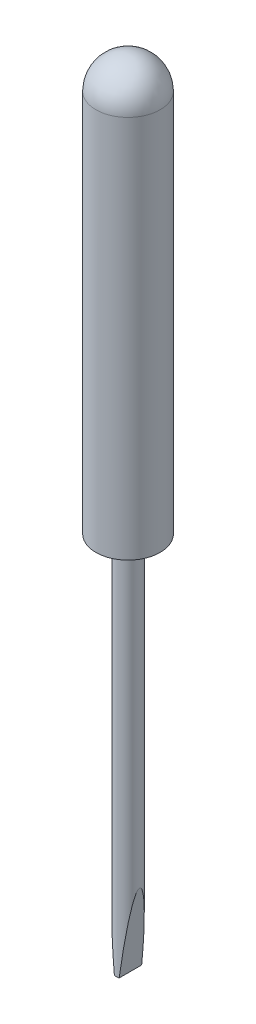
ISO-10303-21;
HEADER;
FILE_DESCRIPTION(('STEP AP214'),'2;1');
FILE_NAME('part.step','',(''),(''),'','','');
FILE_SCHEMA(('AUTOMOTIVE_DESIGN { 1 0 10303 214 1 1 1 1 }'));
ENDSEC;
DATA;
#1=APPLICATION_CONTEXT('core data for automotive mechanical design processes');
#2=APPLICATION_PROTOCOL_DEFINITION('international standard','automotive_design',2000,#1);
#3=PRODUCT_CONTEXT('',#1,'mechanical');
#4=PRODUCT('Part','Part','',(#3));
#5=PRODUCT_RELATED_PRODUCT_CATEGORY('part','',(#4));
#6=PRODUCT_DEFINITION_FORMATION('','',#4);
#7=PRODUCT_DEFINITION_CONTEXT('part definition',#1,'design');
#8=PRODUCT_DEFINITION('design','',#6,#7);
#9=PRODUCT_DEFINITION_SHAPE('','',#8);
#10=(LENGTH_UNIT() NAMED_UNIT(*) SI_UNIT(.MILLI.,.METRE.));
#11=(NAMED_UNIT(*) PLANE_ANGLE_UNIT() SI_UNIT($,.RADIAN.));
#12=(NAMED_UNIT(*) SI_UNIT($,.STERADIAN.) SOLID_ANGLE_UNIT());
#13=UNCERTAINTY_MEASURE_WITH_UNIT(LENGTH_MEASURE(1.E-05),#10,'distance_accuracy_value','');
#14=(GEOMETRIC_REPRESENTATION_CONTEXT(3) GLOBAL_UNCERTAINTY_ASSIGNED_CONTEXT((#13)) GLOBAL_UNIT_ASSIGNED_CONTEXT((#10,
#11,#12)) REPRESENTATION_CONTEXT('',''));
#15=CARTESIAN_POINT('',(0.,0.,0.));
#16=DIRECTION('',(0.,0.,1.));
#17=DIRECTION('',(1.,0.,0.));
#18=AXIS2_PLACEMENT_3D('',#15,#16,#17);
#19=CARTESIAN_POINT('',(0.,50.,0.));
#20=DIRECTION('',(0.,-1.,0.));
#21=DIRECTION('',(0.,0.,-1.));
#22=AXIS2_PLACEMENT_3D('',#19,#20,#21);
#23=CYLINDRICAL_SURFACE('',#22,1.524);
#24=CARTESIAN_POINT('',(0.,50.,0.));
#25=DIRECTION('',(0.,1.,0.));
#26=DIRECTION('',(0.,0.,1.));
#27=AXIS2_PLACEMENT_3D('',#24,#25,#26);
#28=CIRCLE('',#27,1.524);
#29=CARTESIAN_POINT('',(0.,50.,1.524));
#30=VERTEX_POINT('',#29);
#31=EDGE_CURVE('E83',#30,#30,#28,.T.);
#32=ORIENTED_EDGE('',*,*,#31,.F.);
#33=EDGE_LOOP('',(#32));
#34=FACE_BOUND('',#33,.T.);
#35=CARTESIAN_POINT('',(0.,0.,0.));
#36=DIRECTION('',(0.,1.,0.));
#37=DIRECTION('',(0.,0.,1.));
#38=AXIS2_PLACEMENT_3D('',#35,#36,#37);
#39=CIRCLE('',#38,1.524);
#40=CARTESIAN_POINT('',(-0.3175,0.,1.4905602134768));
#41=VERTEX_POINT('',#40);
#42=CARTESIAN_POINT('',(0.3175,0.,1.4905602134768));
#43=VERTEX_POINT('',#42);
#44=EDGE_CURVE('E73',#41,#43,#39,.T.);
#45=ORIENTED_EDGE('',*,*,#44,.T.);
#46=CARTESIAN_POINT('',(0.,-2.67368421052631,0.));
#47=DIRECTION('',(-0.99302292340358,0.117921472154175,0.));
#48=DIRECTION('',(-0.117921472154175,-0.99302292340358,0.));
#49=AXIS2_PLACEMENT_3D('',#46,#47,#48);
#50=ELLIPSE('',#49,12.9238549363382,1.524);
#51=CARTESIAN_POINT('',(0.3175,0.,-1.4905602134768));
#52=VERTEX_POINT('',#51);
#53=EDGE_CURVE('E60',#43,#52,#50,.T.);
#54=ORIENTED_EDGE('',*,*,#53,.T.);
#55=CARTESIAN_POINT('',(-0.3175,0.,-1.4905602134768));
#56=VERTEX_POINT('',#55);
#57=EDGE_CURVE('E66',#52,#56,#39,.T.);
#58=ORIENTED_EDGE('',*,*,#57,.T.);
#59=CARTESIAN_POINT('',(0.,-2.67368421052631,0.));
#60=DIRECTION('',(0.99302292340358,0.117921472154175,0.));
#61=DIRECTION('',(0.117921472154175,-0.99302292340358,0.));
#62=AXIS2_PLACEMENT_3D('',#59,#60,#61);
#63=ELLIPSE('',#62,12.9238549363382,1.524);
#64=EDGE_CURVE('E74',#56,#41,#63,.T.);
#65=ORIENTED_EDGE('',*,*,#64,.T.);
#66=EDGE_LOOP('',(#45,#54,#58,#65));
#67=FACE_BOUND('',#66,.T.);
#68=ADVANCED_FACE('F46',(#34,#67),#23,.T.);
#69=CARTESIAN_POINT('',(0.,0.,0.));
#70=DIRECTION('',(0.,1.,0.));
#71=DIRECTION('',(0.,0.,1.));
#72=AXIS2_PLACEMENT_3D('',#69,#70,#71);
#73=PLANE('',#72);
#74=ORIENTED_EDGE('',*,*,#57,.F.);
#75=DIRECTION('',(0.,0.,1.));
#76=VECTOR('',#75,1.);
#77=CARTESIAN_POINT('',(0.3175,0.,0.));
#78=LINE('',#77,#76);
#79=EDGE_CURVE('E13',#52,#43,#78,.T.);
#80=ORIENTED_EDGE('',*,*,#79,.T.);
#81=ORIENTED_EDGE('',*,*,#44,.F.);
#82=DIRECTION('',(0.,0.,-1.));
#83=VECTOR('',#82,1.);
#84=CARTESIAN_POINT('',(-0.3175,0.,0.));
#85=LINE('',#84,#83);
#86=EDGE_CURVE('E54',#41,#56,#85,.T.);
#87=ORIENTED_EDGE('',*,*,#86,.T.);
#88=EDGE_LOOP('',(#74,#80,#81,#87));
#89=FACE_BOUND('',#88,.T.);
#90=ADVANCED_FACE('F79',(#89),#73,.F.);
#91=CARTESIAN_POINT('',(0.,50.,0.));
#92=DIRECTION('',(0.,1.,0.));
#93=DIRECTION('',(0.,0.,1.));
#94=AXIS2_PLACEMENT_3D('',#91,#92,#93);
#95=PLANE('',#94);
#96=CARTESIAN_POINT('',(0.,50.,0.));
#97=DIRECTION('',(0.,1.,0.));
#98=DIRECTION('',(0.,0.,1.));
#99=AXIS2_PLACEMENT_3D('',#96,#97,#98);
#100=CIRCLE('',#99,4.25);
#101=CARTESIAN_POINT('',(0.,50.,-4.25));
#102=VERTEX_POINT('',#101);
#103=EDGE_CURVE('E85',#102,#102,#100,.T.);
#104=ORIENTED_EDGE('',*,*,#103,.F.);
#105=EDGE_LOOP('',(#104));
#106=FACE_BOUND('',#105,.T.);
#107=ORIENTED_EDGE('',*,*,#31,.T.);
#108=EDGE_LOOP('',(#107));
#109=FACE_BOUND('',#108,.T.);
#110=ADVANCED_FACE('F92',(#106,#109),#95,.F.);
#111=CARTESIAN_POINT('',(0.,100.75,0.));
#112=DIRECTION('',(0.,-1.,0.));
#113=DIRECTION('',(0.,0.,-1.));
#114=AXIS2_PLACEMENT_3D('',#111,#112,#113);
#115=CYLINDRICAL_SURFACE('',#114,4.25);
#116=CARTESIAN_POINT('',(0.,100.75,0.));
#117=DIRECTION('',(0.,1.,0.));
#118=DIRECTION('',(0.,0.,1.));
#119=AXIS2_PLACEMENT_3D('',#116,#117,#118);
#120=CIRCLE('',#119,4.25);
#121=CARTESIAN_POINT('',(0.,100.75,-4.25));
#122=VERTEX_POINT('',#121);
#123=EDGE_CURVE('E81',#122,#122,#120,.T.);
#124=CARTESIAN_POINT('',(0.,100.75,-4.25));
#125=CARTESIAN_POINT('',(0.,100.221354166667,-4.25));
#126=CARTESIAN_POINT('',(0.,99.6927083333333,-4.25));
#127=CARTESIAN_POINT('',(0.,98.6354166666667,-4.25));
#128=CARTESIAN_POINT('',(0.,98.1067708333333,-4.25));
#129=CARTESIAN_POINT('',(0.,97.0494791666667,-4.25));
#130=CARTESIAN_POINT('',(0.,96.5208333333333,-4.25));
#131=CARTESIAN_POINT('',(0.,95.4635416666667,-4.25));
#132=CARTESIAN_POINT('',(0.,94.9348958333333,-4.25));
#133=CARTESIAN_POINT('',(0.,93.8776041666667,-4.25));
#134=CARTESIAN_POINT('',(0.,93.3489583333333,-4.25));
#135=CARTESIAN_POINT('',(0.,92.2916666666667,-4.25));
#136=CARTESIAN_POINT('',(0.,91.7630208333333,-4.25));
#137=CARTESIAN_POINT('',(0.,90.7057291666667,-4.25));
#138=CARTESIAN_POINT('',(0.,90.1770833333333,-4.25));
#139=CARTESIAN_POINT('',(0.,89.1197916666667,-4.25));
#140=CARTESIAN_POINT('',(0.,88.5911458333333,-4.25));
#141=CARTESIAN_POINT('',(0.,87.5338541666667,-4.25));
#142=CARTESIAN_POINT('',(0.,87.0052083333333,-4.25));
#143=CARTESIAN_POINT('',(0.,85.9479166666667,-4.25));
#144=CARTESIAN_POINT('',(0.,85.4192708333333,-4.25));
#145=CARTESIAN_POINT('',(0.,84.3619791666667,-4.25));
#146=CARTESIAN_POINT('',(0.,83.8333333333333,-4.25));
#147=CARTESIAN_POINT('',(0.,82.7760416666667,-4.25));
#148=CARTESIAN_POINT('',(0.,82.2473958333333,-4.25));
#149=CARTESIAN_POINT('',(0.,81.1901041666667,-4.25));
#150=CARTESIAN_POINT('',(0.,80.6614583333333,-4.25));
#151=CARTESIAN_POINT('',(0.,79.6041666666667,-4.25));
#152=CARTESIAN_POINT('',(0.,79.0755208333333,-4.25));
#153=CARTESIAN_POINT('',(0.,78.0182291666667,-4.25));
#154=CARTESIAN_POINT('',(0.,77.4895833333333,-4.25));
#155=CARTESIAN_POINT('',(0.,76.4322916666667,-4.25));
#156=CARTESIAN_POINT('',(0.,75.9036458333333,-4.25));
#157=CARTESIAN_POINT('',(0.,74.8463541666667,-4.25));
#158=CARTESIAN_POINT('',(0.,74.3177083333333,-4.25));
#159=CARTESIAN_POINT('',(0.,73.2604166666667,-4.25));
#160=CARTESIAN_POINT('',(0.,72.7317708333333,-4.25));
#161=CARTESIAN_POINT('',(0.,71.6744791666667,-4.25));
#162=CARTESIAN_POINT('',(0.,71.1458333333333,-4.25));
#163=CARTESIAN_POINT('',(0.,70.0885416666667,-4.25));
#164=CARTESIAN_POINT('',(0.,69.5598958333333,-4.25));
#165=CARTESIAN_POINT('',(0.,68.5026041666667,-4.25));
#166=CARTESIAN_POINT('',(0.,67.9739583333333,-4.25));
#167=CARTESIAN_POINT('',(0.,66.9166666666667,-4.25));
#168=CARTESIAN_POINT('',(0.,66.3880208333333,-4.25));
#169=CARTESIAN_POINT('',(0.,65.3307291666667,-4.25));
#170=CARTESIAN_POINT('',(0.,64.8020833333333,-4.25));
#171=CARTESIAN_POINT('',(0.,63.7447916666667,-4.25));
#172=CARTESIAN_POINT('',(0.,63.2161458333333,-4.25));
#173=CARTESIAN_POINT('',(0.,62.1588541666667,-4.25));
#174=CARTESIAN_POINT('',(0.,61.6302083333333,-4.25));
#175=CARTESIAN_POINT('',(0.,60.5729166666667,-4.25));
#176=CARTESIAN_POINT('',(0.,60.0442708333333,-4.25));
#177=CARTESIAN_POINT('',(0.,58.9869791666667,-4.25));
#178=CARTESIAN_POINT('',(0.,58.4583333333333,-4.25));
#179=CARTESIAN_POINT('',(0.,57.4010416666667,-4.25));
#180=CARTESIAN_POINT('',(0.,56.8723958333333,-4.25));
#181=CARTESIAN_POINT('',(0.,55.8151041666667,-4.25));
#182=CARTESIAN_POINT('',(0.,55.2864583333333,-4.25));
#183=CARTESIAN_POINT('',(0.,54.2291666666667,-4.25));
#184=CARTESIAN_POINT('',(0.,53.7005208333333,-4.25));
#185=CARTESIAN_POINT('',(0.,52.6432291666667,-4.25));
#186=CARTESIAN_POINT('',(0.,52.1145833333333,-4.25));
#187=CARTESIAN_POINT('',(0.,51.0572916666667,-4.25));
#188=CARTESIAN_POINT('',(0.,50.5286458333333,-4.25));
#189=CARTESIAN_POINT('',(0.,50.,-4.25));
#190=B_SPLINE_CURVE_WITH_KNOTS('',3,(#124,#125,#126,#127,#128,#129,#130,#131,#132,#133,#134,
#135,#136,#137,#138,#139,#140,#141,#142,#143,#144,#145,#146,#147,#148,#149,#150,#151,#152,#153,
#154,#155,#156,#157,#158,#159,#160,#161,#162,#163,#164,#165,#166,#167,#168,#169,#170,#171,#172,
#173,#174,#175,#176,#177,#178,#179,#180,#181,#182,#183,#184,#185,#186,#187,#188,#189),
.UNSPECIFIED.,.F.,.F.,(4,2,2,2,2,2,2,2,2,2,2,2,2,2,2,2,2,2,2,2,2,2,2,2,2,2,2,2,2,2,2,2,4),(0.,
1.5859375,3.17187499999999,4.7578125,6.34375,7.92968749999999,9.51562499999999,11.1015625,
12.6875,14.2734375,15.859375,17.4453125,19.03125,20.6171875,22.203125,23.7890625,25.375,
26.9609375,28.546875,30.1328125,31.71875,33.3046875,34.890625,36.4765625,38.0625,39.6484375,
41.234375,42.8203125,44.40625,45.9921875,47.578125,49.1640625,50.75),.UNSPECIFIED.);
#191=EDGE_CURVE('BSEAM100',#122,#102,#190,.T.);
#192=ORIENTED_EDGE('',*,*,#123,.F.);
#193=ORIENTED_EDGE('',*,*,#103,.T.);
#194=ORIENTED_EDGE('',*,*,#191,.T.);
#195=ORIENTED_EDGE('',*,*,#191,.F.);
#196=EDGE_LOOP('',(#192,#194,#193,#195));
#197=FACE_BOUND('',#196,.T.);
#198=ADVANCED_FACE('F100',(#197),#115,.T.);
#199=CARTESIAN_POINT('',(0.,100.75,0.));
#200=DIRECTION('',(0.,0.,1.));
#201=DIRECTION('',(1.,0.,0.));
#202=AXIS2_PLACEMENT_3D('',#199,#200,#201);
#203=SPHERICAL_SURFACE('',#202,4.25);
#204=CARTESIAN_POINT('',(0.,100.75,0.));
#205=DIRECTION('',(0.,1.,0.));
#206=DIRECTION('',(0.,0.,1.));
#207=AXIS2_PLACEMENT_3D('',#204,#205,#206);
#208=SPHERICAL_SURFACE('',#207,4.25);
#209=ORIENTED_EDGE('',*,*,#123,.T.);
#210=EDGE_LOOP('',(#209));
#211=FACE_BOUND('',#210,.T.);
#212=ADVANCED_FACE('F48',(#211),#208,.T.);
#213=CARTESIAN_POINT('',(-0.3175,0.,-4.25));
#214=DIRECTION('',(0.99302292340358,0.117921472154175,0.));
#215=DIRECTION('',(-0.117921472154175,0.99302292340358,0.));
#216=AXIS2_PLACEMENT_3D('',#213,#214,#215);
#217=PLANE('',#216);
#218=ORIENTED_EDGE('',*,*,#86,.F.);
#219=ORIENTED_EDGE('',*,*,#64,.F.);
#220=EDGE_LOOP('',(#218,#219));
#221=FACE_BOUND('',#220,.T.);
#222=ADVANCED_FACE('F107',(#221),#217,.F.);
#223=CARTESIAN_POINT('',(0.3175,0.,-4.25));
#224=DIRECTION('',(-0.99302292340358,0.117921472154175,0.));
#225=DIRECTION('',(-0.117921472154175,-0.99302292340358,0.));
#226=AXIS2_PLACEMENT_3D('',#223,#224,#225);
#227=PLANE('',#226);
#228=ORIENTED_EDGE('',*,*,#79,.F.);
#229=ORIENTED_EDGE('',*,*,#53,.F.);
#230=EDGE_LOOP('',(#228,#229));
#231=FACE_BOUND('',#230,.T.);
#232=ADVANCED_FACE('F76',(#231),#227,.F.);
#233=CLOSED_SHELL('',(#68,#90,#110,#198,#212,#222,#232));
#234=MANIFOLD_SOLID_BREP('B2',#233);
#235=ADVANCED_BREP_SHAPE_REPRESENTATION('',(#18,#234),#14);
#236=SHAPE_DEFINITION_REPRESENTATION(#9,#235);
ENDSEC;
END-ISO-10303-21;
